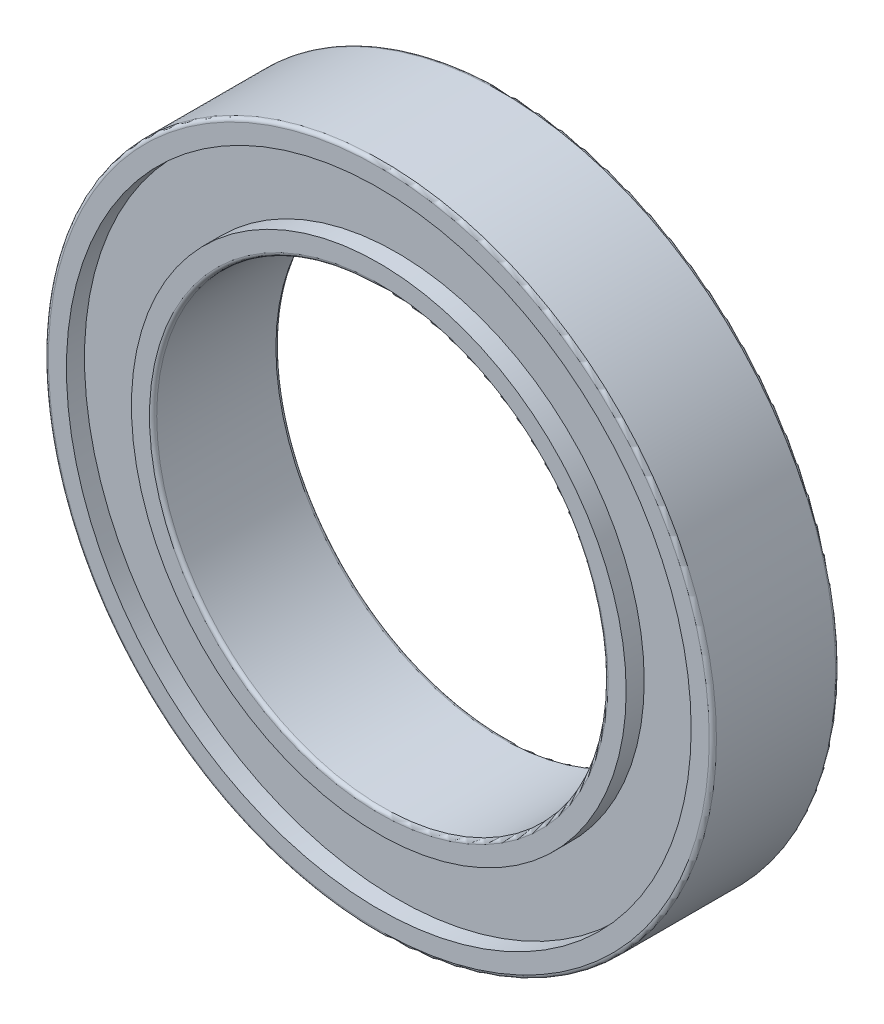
ISO-10303-21;
HEADER;
FILE_DESCRIPTION(('STEP AP214'),'2;1');
FILE_NAME('part.step','',(''),(''),'','','');
FILE_SCHEMA(('AUTOMOTIVE_DESIGN { 1 0 10303 214 1 1 1 1 }'));
ENDSEC;
DATA;
#1=APPLICATION_CONTEXT('core data for automotive mechanical design processes');
#2=APPLICATION_PROTOCOL_DEFINITION('international standard','automotive_design',2000,#1);
#3=PRODUCT_CONTEXT('',#1,'mechanical');
#4=PRODUCT('Part','Part','',(#3));
#5=PRODUCT_RELATED_PRODUCT_CATEGORY('part','',(#4));
#6=PRODUCT_DEFINITION_FORMATION('','',#4);
#7=PRODUCT_DEFINITION_CONTEXT('part definition',#1,'design');
#8=PRODUCT_DEFINITION('design','',#6,#7);
#9=PRODUCT_DEFINITION_SHAPE('','',#8);
#10=(LENGTH_UNIT() NAMED_UNIT(*) SI_UNIT(.MILLI.,.METRE.));
#11=(NAMED_UNIT(*) PLANE_ANGLE_UNIT() SI_UNIT($,.RADIAN.));
#12=(NAMED_UNIT(*) SI_UNIT($,.STERADIAN.) SOLID_ANGLE_UNIT());
#13=UNCERTAINTY_MEASURE_WITH_UNIT(LENGTH_MEASURE(1.E-05),#10,'distance_accuracy_value','');
#14=(GEOMETRIC_REPRESENTATION_CONTEXT(3) GLOBAL_UNCERTAINTY_ASSIGNED_CONTEXT((#13)) GLOBAL_UNIT_ASSIGNED_CONTEXT((#10,
#11,#12)) REPRESENTATION_CONTEXT('',''));
#15=CARTESIAN_POINT('',(0.,0.,0.));
#16=DIRECTION('',(0.,0.,1.));
#17=DIRECTION('',(1.,0.,0.));
#18=AXIS2_PLACEMENT_3D('',#15,#16,#17);
#19=CARTESIAN_POINT('',(0.,0.,0.));
#20=DIRECTION('',(0.,0.,1.));
#21=DIRECTION('',(1.,0.,0.));
#22=AXIS2_PLACEMENT_3D('',#19,#20,#21);
#23=PLANE('',#22);
#24=CARTESIAN_POINT('',(0.,0.,0.));
#25=DIRECTION('',(0.,0.,1.));
#26=DIRECTION('',(1.,0.,0.));
#27=AXIS2_PLACEMENT_3D('',#24,#25,#26);
#28=CIRCLE('',#27,12.7);
#29=CARTESIAN_POINT('',(12.7,0.,0.));
#30=VERTEX_POINT('',#29);
#31=EDGE_CURVE('E52',#30,#30,#28,.T.);
#32=ORIENTED_EDGE('',*,*,#31,.T.);
#33=EDGE_LOOP('',(#32));
#34=FACE_BOUND('',#33,.T.);
#35=CARTESIAN_POINT('',(0.,0.,0.));
#36=DIRECTION('',(0.,0.,-1.));
#37=DIRECTION('',(-1.,0.,0.));
#38=AXIS2_PLACEMENT_3D('',#35,#36,#37);
#39=CIRCLE('',#38,13.7);
#40=CARTESIAN_POINT('',(-13.7,0.,0.));
#41=VERTEX_POINT('',#40);
#42=EDGE_CURVE('E83',#41,#41,#39,.T.);
#43=ORIENTED_EDGE('',*,*,#42,.T.);
#44=EDGE_LOOP('',(#43));
#45=FACE_BOUND('',#44,.T.);
#46=ADVANCED_FACE('F32',(#34,#45),#23,.F.);
#47=CARTESIAN_POINT('',(0.,0.,7.));
#48=DIRECTION('',(0.,0.,1.));
#49=DIRECTION('',(1.,0.,0.));
#50=AXIS2_PLACEMENT_3D('',#47,#48,#49);
#51=PLANE('',#50);
#52=CARTESIAN_POINT('',(0.,0.,7.));
#53=DIRECTION('',(0.,0.,1.));
#54=DIRECTION('',(1.,0.,0.));
#55=AXIS2_PLACEMENT_3D('',#52,#53,#54);
#56=CIRCLE('',#55,12.7);
#57=CARTESIAN_POINT('',(12.7,0.,7.));
#58=VERTEX_POINT('',#57);
#59=EDGE_CURVE('E55',#58,#58,#56,.F.);
#60=ORIENTED_EDGE('',*,*,#59,.T.);
#61=EDGE_LOOP('',(#60));
#62=FACE_BOUND('',#61,.T.);
#63=CARTESIAN_POINT('',(0.,0.,7.));
#64=DIRECTION('',(0.,0.,1.));
#65=DIRECTION('',(1.,0.,0.));
#66=AXIS2_PLACEMENT_3D('',#63,#64,#65);
#67=CIRCLE('',#66,13.7);
#68=CARTESIAN_POINT('',(13.7,0.,7.));
#69=VERTEX_POINT('',#68);
#70=EDGE_CURVE('E71',#69,#69,#67,.T.);
#71=ORIENTED_EDGE('',*,*,#70,.T.);
#72=EDGE_LOOP('',(#71));
#73=FACE_BOUND('',#72,.T.);
#74=ADVANCED_FACE('F117',(#62,#73),#51,.T.);
#75=CARTESIAN_POINT('',(0.,0.,7.));
#76=DIRECTION('',(0.,0.,1.));
#77=DIRECTION('',(1.,0.,0.));
#78=AXIS2_PLACEMENT_3D('',#75,#76,#77);
#79=CIRCLE('',#78,18.3);
#80=CARTESIAN_POINT('',(18.3,0.,7.));
#81=VERTEX_POINT('',#80);
#82=EDGE_CURVE('E10',#81,#81,#79,.T.);
#83=ORIENTED_EDGE('',*,*,#82,.T.);
#84=EDGE_LOOP('',(#83));
#85=FACE_BOUND('',#84,.T.);
#86=CARTESIAN_POINT('',(0.,0.,7.));
#87=DIRECTION('',(0.,0.,1.));
#88=DIRECTION('',(1.,0.,0.));
#89=AXIS2_PLACEMENT_3D('',#86,#87,#88);
#90=CIRCLE('',#89,17.3);
#91=CARTESIAN_POINT('',(17.3,0.,7.));
#92=VERTEX_POINT('',#91);
#93=EDGE_CURVE('E65',#92,#92,#90,.T.);
#94=ORIENTED_EDGE('',*,*,#93,.F.);
#95=EDGE_LOOP('',(#94));
#96=FACE_BOUND('',#95,.T.);
#97=ADVANCED_FACE('F108',(#85,#96),#51,.T.);
#98=CARTESIAN_POINT('',(0.,0.,0.));
#99=DIRECTION('',(0.,0.,1.));
#100=DIRECTION('',(1.,0.,0.));
#101=AXIS2_PLACEMENT_3D('',#98,#99,#100);
#102=CIRCLE('',#101,18.3);
#103=CARTESIAN_POINT('',(18.3,0.,0.));
#104=VERTEX_POINT('',#103);
#105=EDGE_CURVE('E39',#104,#104,#102,.F.);
#106=ORIENTED_EDGE('',*,*,#105,.T.);
#107=EDGE_LOOP('',(#106));
#108=FACE_BOUND('',#107,.T.);
#109=CARTESIAN_POINT('',(0.,0.,0.));
#110=DIRECTION('',(0.,0.,-1.));
#111=DIRECTION('',(-1.,0.,0.));
#112=AXIS2_PLACEMENT_3D('',#109,#110,#111);
#113=CIRCLE('',#112,17.3);
#114=CARTESIAN_POINT('',(-17.3,0.,0.));
#115=VERTEX_POINT('',#114);
#116=EDGE_CURVE('E77',#115,#115,#113,.T.);
#117=ORIENTED_EDGE('',*,*,#116,.F.);
#118=EDGE_LOOP('',(#117));
#119=FACE_BOUND('',#118,.T.);
#120=ADVANCED_FACE('F105',(#108,#119),#23,.F.);
#121=CARTESIAN_POINT('',(0.,0.,7.));
#122=DIRECTION('',(0.,0.,-1.));
#123=DIRECTION('',(-1.,0.,0.));
#124=AXIS2_PLACEMENT_3D('',#121,#122,#123);
#125=CYLINDRICAL_SURFACE('',#124,18.5);
#126=CARTESIAN_POINT('',(0.,0.,0.2));
#127=DIRECTION('',(0.,0.,1.));
#128=DIRECTION('',(1.,0.,0.));
#129=AXIS2_PLACEMENT_3D('',#126,#127,#128);
#130=CIRCLE('',#129,18.5);
#131=CARTESIAN_POINT('',(18.5,0.,0.2));
#132=VERTEX_POINT('',#131);
#133=EDGE_CURVE('E43',#132,#132,#130,.T.);
#134=ORIENTED_EDGE('',*,*,#133,.T.);
#135=EDGE_LOOP('',(#134));
#136=FACE_BOUND('',#135,.T.);
#137=CARTESIAN_POINT('',(0.,0.,6.8));
#138=DIRECTION('',(0.,0.,1.));
#139=DIRECTION('',(1.,0.,0.));
#140=AXIS2_PLACEMENT_3D('',#137,#138,#139);
#141=CIRCLE('',#140,18.5);
#142=CARTESIAN_POINT('',(18.5,0.,6.8));
#143=VERTEX_POINT('',#142);
#144=EDGE_CURVE('E47',#143,#143,#141,.F.);
#145=ORIENTED_EDGE('',*,*,#144,.T.);
#146=EDGE_LOOP('',(#145));
#147=FACE_BOUND('',#146,.T.);
#148=ADVANCED_FACE('F107',(#136,#147),#125,.T.);
#149=CARTESIAN_POINT('',(0.,0.,7.));
#150=DIRECTION('',(0.,0.,-1.));
#151=DIRECTION('',(-1.,0.,0.));
#152=AXIS2_PLACEMENT_3D('',#149,#150,#151);
#153=CYLINDRICAL_SURFACE('',#152,12.5);
#154=CARTESIAN_POINT('',(0.,0.,6.8));
#155=DIRECTION('',(0.,0.,1.));
#156=DIRECTION('',(1.,0.,0.));
#157=AXIS2_PLACEMENT_3D('',#154,#155,#156);
#158=CIRCLE('',#157,12.5);
#159=CARTESIAN_POINT('',(12.5,0.,6.8));
#160=VERTEX_POINT('',#159);
#161=EDGE_CURVE('E58',#160,#160,#158,.T.);
#162=ORIENTED_EDGE('',*,*,#161,.T.);
#163=EDGE_LOOP('',(#162));
#164=FACE_BOUND('',#163,.T.);
#165=CARTESIAN_POINT('',(0.,0.,0.2));
#166=DIRECTION('',(0.,0.,1.));
#167=DIRECTION('',(1.,0.,0.));
#168=AXIS2_PLACEMENT_3D('',#165,#166,#167);
#169=CIRCLE('',#168,12.5);
#170=CARTESIAN_POINT('',(12.5,0.,0.2));
#171=VERTEX_POINT('',#170);
#172=EDGE_CURVE('E61',#171,#171,#169,.F.);
#173=ORIENTED_EDGE('',*,*,#172,.T.);
#174=EDGE_LOOP('',(#173));
#175=FACE_BOUND('',#174,.T.);
#176=ADVANCED_FACE('F114',(#164,#175),#153,.F.);
#177=CARTESIAN_POINT('',(0.,0.,6.));
#178=DIRECTION('',(0.,0.,1.));
#179=DIRECTION('',(1.,0.,0.));
#180=AXIS2_PLACEMENT_3D('',#177,#178,#179);
#181=CYLINDRICAL_SURFACE('',#180,17.3);
#182=CARTESIAN_POINT('',(0.,0.,6.));
#183=DIRECTION('',(0.,0.,1.));
#184=DIRECTION('',(1.,0.,0.));
#185=AXIS2_PLACEMENT_3D('',#182,#183,#184);
#186=CIRCLE('',#185,17.3);
#187=CARTESIAN_POINT('',(17.3,0.,6.));
#188=VERTEX_POINT('',#187);
#189=EDGE_CURVE('E64',#188,#188,#186,.T.);
#190=ORIENTED_EDGE('',*,*,#189,.F.);
#191=EDGE_LOOP('',(#190));
#192=FACE_BOUND('',#191,.T.);
#193=ORIENTED_EDGE('',*,*,#93,.T.);
#194=EDGE_LOOP('',(#193));
#195=FACE_BOUND('',#194,.T.);
#196=ADVANCED_FACE('F144',(#192,#195),#181,.F.);
#197=CARTESIAN_POINT('',(0.,0.,6.));
#198=DIRECTION('',(0.,0.,1.));
#199=DIRECTION('',(1.,0.,0.));
#200=AXIS2_PLACEMENT_3D('',#197,#198,#199);
#201=PLANE('',#200);
#202=CARTESIAN_POINT('',(0.,0.,6.));
#203=DIRECTION('',(0.,0.,1.));
#204=DIRECTION('',(1.,0.,0.));
#205=AXIS2_PLACEMENT_3D('',#202,#203,#204);
#206=CIRCLE('',#205,13.7);
#207=CARTESIAN_POINT('',(13.7,0.,6.));
#208=VERTEX_POINT('',#207);
#209=EDGE_CURVE('E68',#208,#208,#206,.T.);
#210=ORIENTED_EDGE('',*,*,#209,.F.);
#211=EDGE_LOOP('',(#210));
#212=FACE_BOUND('',#211,.T.);
#213=ORIENTED_EDGE('',*,*,#189,.T.);
#214=EDGE_LOOP('',(#213));
#215=FACE_BOUND('',#214,.T.);
#216=ADVANCED_FACE('F140',(#212,#215),#201,.T.);
#217=CARTESIAN_POINT('',(0.,0.,6.));
#218=DIRECTION('',(0.,0.,1.));
#219=DIRECTION('',(1.,0.,0.));
#220=AXIS2_PLACEMENT_3D('',#217,#218,#219);
#221=CYLINDRICAL_SURFACE('',#220,13.7);
#222=ORIENTED_EDGE('',*,*,#209,.T.);
#223=EDGE_LOOP('',(#222));
#224=FACE_BOUND('',#223,.T.);
#225=ORIENTED_EDGE('',*,*,#70,.F.);
#226=EDGE_LOOP('',(#225));
#227=FACE_BOUND('',#226,.T.);
#228=ADVANCED_FACE('F101',(#224,#227),#221,.T.);
#229=CARTESIAN_POINT('',(0.,0.,1.));
#230=DIRECTION('',(0.,0.,-1.));
#231=DIRECTION('',(-1.,0.,0.));
#232=AXIS2_PLACEMENT_3D('',#229,#230,#231);
#233=CYLINDRICAL_SURFACE('',#232,17.3);
#234=CARTESIAN_POINT('',(0.,0.,1.));
#235=DIRECTION('',(0.,0.,-1.));
#236=DIRECTION('',(-1.,0.,0.));
#237=AXIS2_PLACEMENT_3D('',#234,#235,#236);
#238=CIRCLE('',#237,17.3);
#239=CARTESIAN_POINT('',(-17.3,0.,1.));
#240=VERTEX_POINT('',#239);
#241=EDGE_CURVE('E74',#240,#240,#238,.T.);
#242=ORIENTED_EDGE('',*,*,#241,.F.);
#243=EDGE_LOOP('',(#242));
#244=FACE_BOUND('',#243,.T.);
#245=ORIENTED_EDGE('',*,*,#116,.T.);
#246=EDGE_LOOP('',(#245));
#247=FACE_BOUND('',#246,.T.);
#248=ADVANCED_FACE('F95',(#244,#247),#233,.F.);
#249=CARTESIAN_POINT('',(0.,0.,1.));
#250=DIRECTION('',(0.,0.,-1.));
#251=DIRECTION('',(-1.,0.,0.));
#252=AXIS2_PLACEMENT_3D('',#249,#250,#251);
#253=PLANE('',#252);
#254=CARTESIAN_POINT('',(0.,0.,1.));
#255=DIRECTION('',(0.,0.,-1.));
#256=DIRECTION('',(-1.,0.,0.));
#257=AXIS2_PLACEMENT_3D('',#254,#255,#256);
#258=CIRCLE('',#257,13.7);
#259=CARTESIAN_POINT('',(-13.7,0.,1.));
#260=VERTEX_POINT('',#259);
#261=EDGE_CURVE('E80',#260,#260,#258,.T.);
#262=ORIENTED_EDGE('',*,*,#261,.F.);
#263=EDGE_LOOP('',(#262));
#264=FACE_BOUND('',#263,.T.);
#265=ORIENTED_EDGE('',*,*,#241,.T.);
#266=EDGE_LOOP('',(#265));
#267=FACE_BOUND('',#266,.T.);
#268=ADVANCED_FACE('F92',(#264,#267),#253,.T.);
#269=CARTESIAN_POINT('',(0.,0.,1.));
#270=DIRECTION('',(0.,0.,-1.));
#271=DIRECTION('',(-1.,0.,0.));
#272=AXIS2_PLACEMENT_3D('',#269,#270,#271);
#273=CYLINDRICAL_SURFACE('',#272,13.7);
#274=ORIENTED_EDGE('',*,*,#261,.T.);
#275=EDGE_LOOP('',(#274));
#276=FACE_BOUND('',#275,.T.);
#277=ORIENTED_EDGE('',*,*,#42,.F.);
#278=EDGE_LOOP('',(#277));
#279=FACE_BOUND('',#278,.T.);
#280=ADVANCED_FACE('F89',(#276,#279),#273,.T.);
#281=CARTESIAN_POINT('',(0.,0.,6.8));
#282=DIRECTION('',(0.,0.,1.));
#283=DIRECTION('',(1.,0.,0.));
#284=AXIS2_PLACEMENT_3D('',#281,#282,#283);
#285=TOROIDAL_SURFACE('',#284,12.7,0.2);
#286=ORIENTED_EDGE('',*,*,#59,.F.);
#287=EDGE_LOOP('',(#286));
#288=FACE_BOUND('',#287,.T.);
#289=ORIENTED_EDGE('',*,*,#161,.F.);
#290=EDGE_LOOP('',(#289));
#291=FACE_BOUND('',#290,.T.);
#292=ADVANCED_FACE('F129',(#288,#291),#285,.T.);
#293=CARTESIAN_POINT('',(0.,0.,0.2));
#294=DIRECTION('',(0.,0.,1.));
#295=DIRECTION('',(1.,0.,0.));
#296=AXIS2_PLACEMENT_3D('',#293,#294,#295);
#297=TOROIDAL_SURFACE('',#296,12.7,0.2);
#298=ORIENTED_EDGE('',*,*,#172,.F.);
#299=EDGE_LOOP('',(#298));
#300=FACE_BOUND('',#299,.T.);
#301=ORIENTED_EDGE('',*,*,#31,.F.);
#302=EDGE_LOOP('',(#301));
#303=FACE_BOUND('',#302,.T.);
#304=ADVANCED_FACE('F134',(#300,#303),#297,.T.);
#305=CARTESIAN_POINT('',(0.,0.,0.2));
#306=DIRECTION('',(0.,0.,1.));
#307=DIRECTION('',(1.,0.,0.));
#308=AXIS2_PLACEMENT_3D('',#305,#306,#307);
#309=TOROIDAL_SURFACE('',#308,18.3,0.2);
#310=ORIENTED_EDGE('',*,*,#105,.F.);
#311=EDGE_LOOP('',(#310));
#312=FACE_BOUND('',#311,.T.);
#313=ORIENTED_EDGE('',*,*,#133,.F.);
#314=EDGE_LOOP('',(#313));
#315=FACE_BOUND('',#314,.T.);
#316=ADVANCED_FACE('F159',(#312,#315),#309,.T.);
#317=CARTESIAN_POINT('',(0.,0.,6.8));
#318=DIRECTION('',(0.,0.,1.));
#319=DIRECTION('',(1.,0.,0.));
#320=AXIS2_PLACEMENT_3D('',#317,#318,#319);
#321=TOROIDAL_SURFACE('',#320,18.3,0.2);
#322=ORIENTED_EDGE('',*,*,#144,.F.);
#323=EDGE_LOOP('',(#322));
#324=FACE_BOUND('',#323,.T.);
#325=ORIENTED_EDGE('',*,*,#82,.F.);
#326=EDGE_LOOP('',(#325));
#327=FACE_BOUND('',#326,.T.);
#328=ADVANCED_FACE('F34',(#324,#327),#321,.T.);
#329=CLOSED_SHELL('',(#46,#74,#97,#120,#148,#176,#196,#216,#228,#248,#268,#280,#292,#304,#316,#328));
#330=MANIFOLD_SOLID_BREP('B2',#329);
#331=ADVANCED_BREP_SHAPE_REPRESENTATION('',(#18,#330),#14);
#332=SHAPE_DEFINITION_REPRESENTATION(#9,#331);
ENDSEC;
END-ISO-10303-21;
